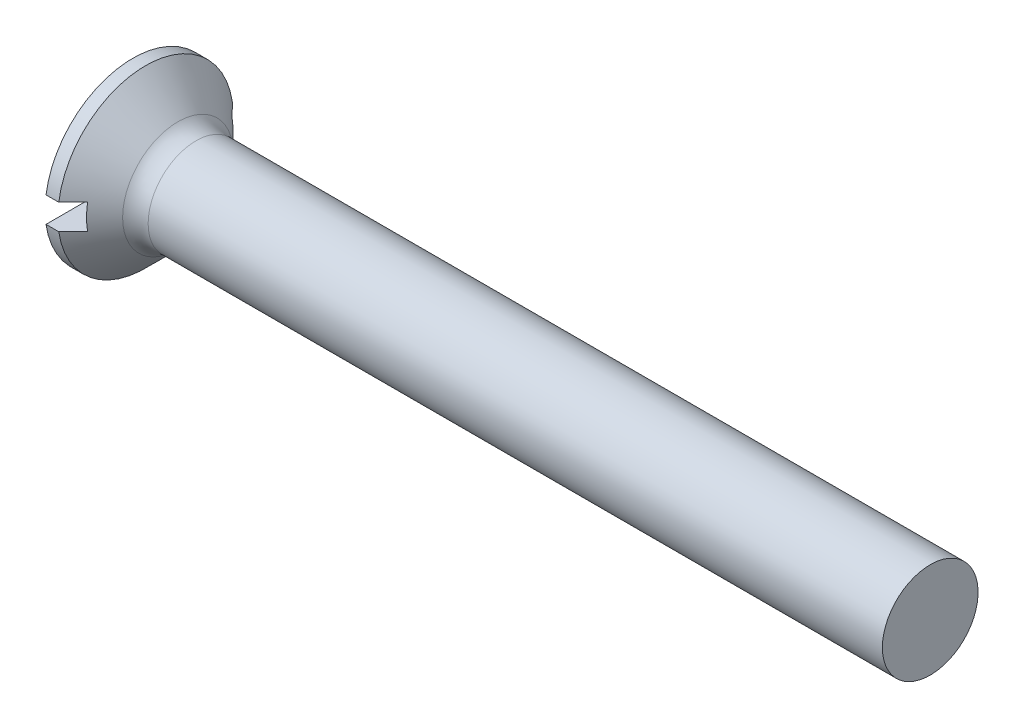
ISO-10303-21;
HEADER;
FILE_DESCRIPTION(('STEP AP214'),'2;1');
FILE_NAME('part.step','',(''),(''),'','','');
FILE_SCHEMA(('AUTOMOTIVE_DESIGN { 1 0 10303 214 1 1 1 1 }'));
ENDSEC;
DATA;
#1=APPLICATION_CONTEXT('core data for automotive mechanical design processes');
#2=APPLICATION_PROTOCOL_DEFINITION('international standard','automotive_design',2000,#1);
#3=PRODUCT_CONTEXT('',#1,'mechanical');
#4=PRODUCT('Part','Part','',(#3));
#5=PRODUCT_RELATED_PRODUCT_CATEGORY('part','',(#4));
#6=PRODUCT_DEFINITION_FORMATION('','',#4);
#7=PRODUCT_DEFINITION_CONTEXT('part definition',#1,'design');
#8=PRODUCT_DEFINITION('design','',#6,#7);
#9=PRODUCT_DEFINITION_SHAPE('','',#8);
#10=(LENGTH_UNIT() NAMED_UNIT(*) SI_UNIT(.MILLI.,.METRE.));
#11=(NAMED_UNIT(*) PLANE_ANGLE_UNIT() SI_UNIT($,.RADIAN.));
#12=(NAMED_UNIT(*) SI_UNIT($,.STERADIAN.) SOLID_ANGLE_UNIT());
#13=UNCERTAINTY_MEASURE_WITH_UNIT(LENGTH_MEASURE(1.E-05),#10,'distance_accuracy_value','');
#14=(GEOMETRIC_REPRESENTATION_CONTEXT(3) GLOBAL_UNCERTAINTY_ASSIGNED_CONTEXT((#13)) GLOBAL_UNIT_ASSIGNED_CONTEXT((#10,
#11,#12)) REPRESENTATION_CONTEXT('',''));
#15=CARTESIAN_POINT('',(0.,0.,0.));
#16=DIRECTION('',(0.,0.,1.));
#17=DIRECTION('',(1.,0.,0.));
#18=AXIS2_PLACEMENT_3D('',#15,#16,#17);
#19=CARTESIAN_POINT('',(0.,0.,0.));
#20=DIRECTION('',(-1.,0.,0.));
#21=DIRECTION('',(0.,0.,1.));
#22=AXIS2_PLACEMENT_3D('',#19,#20,#21);
#23=PLANE('',#22);
#24=DIRECTION('',(0.,0.,-1.));
#25=VECTOR('',#24,1.);
#26=CARTESIAN_POINT('',(0.,0.4,2.75));
#27=LINE('',#26,#25);
#28=CARTESIAN_POINT('',(0.,0.4,2.72075357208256));
#29=VERTEX_POINT('',#28);
#30=CARTESIAN_POINT('',(0.,0.4,-2.72075357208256));
#31=VERTEX_POINT('',#30);
#32=EDGE_CURVE('E177',#29,#31,#27,.T.);
#33=ORIENTED_EDGE('',*,*,#32,.F.);
#34=CARTESIAN_POINT('',(0.,0.,0.));
#35=DIRECTION('',(-1.,0.,0.));
#36=DIRECTION('',(0.,0.,1.));
#37=AXIS2_PLACEMENT_3D('',#34,#35,#36);
#38=CIRCLE('',#37,2.75);
#39=EDGE_CURVE('E142',#29,#31,#38,.T.);
#40=ORIENTED_EDGE('',*,*,#39,.T.);
#41=EDGE_LOOP('',(#33,#40));
#42=FACE_BOUND('',#41,.T.);
#43=ADVANCED_FACE('F36',(#42),#23,.T.);
#44=CARTESIAN_POINT('',(-6.34999999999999,0.,0.));
#45=DIRECTION('',(-1.,0.,0.));
#46=DIRECTION('',(0.,0.,1.));
#47=AXIS2_PLACEMENT_3D('',#44,#45,#46);
#48=CYLINDRICAL_SURFACE('',#47,2.75);
#49=DIRECTION('',(-1.,0.,0.));
#50=VECTOR('',#49,1.);
#51=CARTESIAN_POINT('',(-6.34999999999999,0.4,-2.72075357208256));
#52=LINE('',#51,#50);
#53=CARTESIAN_POINT('',(0.400000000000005,0.4,-2.72075357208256));
#54=VERTEX_POINT('',#53);
#55=EDGE_CURVE('E64',#31,#54,#52,.F.);
#56=ORIENTED_EDGE('',*,*,#55,.F.);
#57=ORIENTED_EDGE('',*,*,#39,.F.);
#58=DIRECTION('',(-1.,0.,0.));
#59=VECTOR('',#58,1.);
#60=CARTESIAN_POINT('',(-6.34999999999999,0.4,2.72075357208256));
#61=LINE('',#60,#59);
#62=CARTESIAN_POINT('',(0.400000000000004,0.4,2.72075357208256));
#63=VERTEX_POINT('',#62);
#64=EDGE_CURVE('E183',#63,#29,#61,.T.);
#65=ORIENTED_EDGE('',*,*,#64,.F.);
#66=CARTESIAN_POINT('',(0.400000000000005,0.,0.));
#67=DIRECTION('',(-1.,0.,0.));
#68=DIRECTION('',(0.,0.,1.));
#69=AXIS2_PLACEMENT_3D('',#66,#67,#68);
#70=CIRCLE('',#69,2.75);
#71=EDGE_CURVE('E113',#63,#54,#70,.T.);
#72=ORIENTED_EDGE('',*,*,#71,.T.);
#73=EDGE_LOOP('',(#56,#57,#65,#72));
#74=FACE_BOUND('',#73,.T.);
#75=ADVANCED_FACE('F164',(#74),#48,.T.);
#76=DIRECTION('',(0.,0.,1.));
#77=VECTOR('',#76,1.);
#78=CARTESIAN_POINT('',(0.,-0.400000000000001,-2.75));
#79=LINE('',#78,#77);
#80=CARTESIAN_POINT('',(0.,-0.400000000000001,-2.72075357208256));
#81=VERTEX_POINT('',#80);
#82=CARTESIAN_POINT('',(0.,-0.400000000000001,2.72075357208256));
#83=VERTEX_POINT('',#82);
#84=EDGE_CURVE('E107',#81,#83,#79,.T.);
#85=ORIENTED_EDGE('',*,*,#84,.F.);
#86=EDGE_CURVE('E132',#81,#83,#38,.T.);
#87=ORIENTED_EDGE('',*,*,#86,.T.);
#88=EDGE_LOOP('',(#85,#87));
#89=FACE_BOUND('',#88,.T.);
#90=ADVANCED_FACE('F162',(#89),#23,.T.);
#91=DIRECTION('',(-1.,0.,0.));
#92=VECTOR('',#91,1.);
#93=CARTESIAN_POINT('',(-6.34999999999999,-0.400000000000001,2.72075357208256));
#94=LINE('',#93,#92);
#95=CARTESIAN_POINT('',(0.400000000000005,-0.400000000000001,2.72075357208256));
#96=VERTEX_POINT('',#95);
#97=EDGE_CURVE('E133',#83,#96,#94,.F.);
#98=ORIENTED_EDGE('',*,*,#97,.F.);
#99=ORIENTED_EDGE('',*,*,#86,.F.);
#100=DIRECTION('',(-1.,0.,0.));
#101=VECTOR('',#100,1.);
#102=CARTESIAN_POINT('',(-6.34999999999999,-0.400000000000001,-2.72075357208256));
#103=LINE('',#102,#101);
#104=CARTESIAN_POINT('',(0.400000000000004,-0.400000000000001,-2.72075357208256));
#105=VERTEX_POINT('',#104);
#106=EDGE_CURVE('E122',#105,#81,#103,.T.);
#107=ORIENTED_EDGE('',*,*,#106,.F.);
#108=EDGE_CURVE('E130',#105,#96,#70,.T.);
#109=ORIENTED_EDGE('',*,*,#108,.T.);
#110=EDGE_LOOP('',(#98,#99,#107,#109));
#111=FACE_BOUND('',#110,.T.);
#112=ADVANCED_FACE('F129',(#111),#48,.T.);
#113=CARTESIAN_POINT('',(0.400000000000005,0.,0.));
#114=DIRECTION('',(-1.,0.,0.));
#115=DIRECTION('',(0.,0.,1.));
#116=AXIS2_PLACEMENT_3D('',#113,#114,#115);
#117=CONICAL_SURFACE('',#116,2.75,0.78539816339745);
#118=CARTESIAN_POINT('',(-2.91122703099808,0.399999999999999,-6.04801398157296));
#119=CARTESIAN_POINT('',(-2.70333669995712,0.399999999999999,-5.83966573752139));
#120=CARTESIAN_POINT('',(-2.49546630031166,0.399999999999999,-5.63129758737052));
#121=CARTESIAN_POINT('',(-2.07978706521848,0.399999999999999,-5.2144912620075));
#122=CARTESIAN_POINT('',(-1.87197823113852,0.399999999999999,-5.00605308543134));
#123=CARTESIAN_POINT('',(-1.45635477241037,0.399999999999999,-4.58898711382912));
#124=CARTESIAN_POINT('',(-1.2485401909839,0.399999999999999,-4.38035927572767));
#125=CARTESIAN_POINT('',(-0.833054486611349,0.399999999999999,-3.96296915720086));
#126=CARTESIAN_POINT('',(-0.625383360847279,0.399999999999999,-3.75420687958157));
#127=CARTESIAN_POINT('',(-0.208177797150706,0.399999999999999,-3.33435396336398));
#128=CARTESIAN_POINT('',(0.00135434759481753,0.4,-3.12326104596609));
#129=CARTESIAN_POINT('',(0.420030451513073,0.4,-2.70066518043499));
#130=CARTESIAN_POINT('',(0.629174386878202,0.4,-2.48916220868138));
#131=CARTESIAN_POINT('',(0.942224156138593,0.4,-2.1713129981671));
#132=CARTESIAN_POINT('',(1.04644766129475,0.4,-2.06527989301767));
#133=CARTESIAN_POINT('',(1.25455725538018,0.4,-1.85287805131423));
#134=CARTESIAN_POINT('',(1.35844333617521,0.4,-1.7465093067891));
#135=CARTESIAN_POINT('',(1.56564763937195,0.4,-1.53324094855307));
#136=CARTESIAN_POINT('',(1.66896592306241,0.4,-1.42634139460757));
#137=CARTESIAN_POINT('',(1.82313895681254,0.4,-1.26522565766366));
#138=CARTESIAN_POINT('',(1.87439491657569,0.4,-1.21139372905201));
#139=CARTESIAN_POINT('',(1.9765104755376,0.4,-1.10335558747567));
#140=CARTESIAN_POINT('',(2.02737008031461,0.4,-1.04914937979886));
#141=CARTESIAN_POINT('',(2.10536761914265,0.4,-0.965078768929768));
#142=CARTESIAN_POINT('',(2.13272119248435,0.4,-0.935414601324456));
#143=CARTESIAN_POINT('',(2.18719151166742,0.4,-0.875868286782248));
#144=CARTESIAN_POINT('',(2.21430825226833,0.4,-0.845986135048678));
#145=CARTESIAN_POINT('',(2.26822565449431,0.4,-0.785940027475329));
#146=CARTESIAN_POINT('',(2.29502633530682,0.4,-0.755776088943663));
#147=CARTESIAN_POINT('',(2.34818681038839,0.4,-0.695065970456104));
#148=CARTESIAN_POINT('',(2.37454662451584,0.4,-0.664519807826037));
#149=CARTESIAN_POINT('',(2.43976155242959,0.4,-0.587422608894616));
#150=CARTESIAN_POINT('',(2.4782379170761,0.4,-0.540543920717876));
#151=CARTESIAN_POINT('',(2.53401321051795,0.4,-0.468681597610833));
#152=CARTESIAN_POINT('',(2.55228877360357,0.4,-0.444459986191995));
#153=CARTESIAN_POINT('',(2.5878711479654,0.4,-0.39531915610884));
#154=CARTESIAN_POINT('',(2.60517823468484,0.4,-0.370400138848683));
#155=CARTESIAN_POINT('',(2.64157672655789,0.4,-0.314684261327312));
#156=CARTESIAN_POINT('',(2.66036306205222,0.4,-0.28368484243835));
#157=CARTESIAN_POINT('',(2.69440764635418,0.4,-0.219761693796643));
#158=CARTESIAN_POINT('',(2.70967206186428,0.4,-0.186841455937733));
#159=CARTESIAN_POINT('',(2.73016014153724,0.4,-0.129375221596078));
#160=CARTESIAN_POINT('',(2.73703138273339,0.4,-0.105439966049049));
#161=CARTESIAN_POINT('',(2.74668434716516,0.4,-0.0567945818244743));
#162=CARTESIAN_POINT('',(2.74948035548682,0.4,-0.0320874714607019));
#163=CARTESIAN_POINT('',(2.75038742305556,0.4,0.0175418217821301));
#164=CARTESIAN_POINT('',(2.74847509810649,0.4,0.0424644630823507));
#165=CARTESIAN_POINT('',(2.7403655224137,0.4,0.0916234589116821));
#166=CARTESIAN_POINT('',(2.73415677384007,0.4,0.115857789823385));
#167=CARTESIAN_POINT('',(2.71827371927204,0.4,0.164097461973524));
#168=CARTESIAN_POINT('',(2.70848082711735,0.4,0.188061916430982));
#169=CARTESIAN_POINT('',(2.68657810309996,0.4,0.234925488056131));
#170=CARTESIAN_POINT('',(2.67446406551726,0.4,0.257822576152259));
#171=CARTESIAN_POINT('',(2.64859519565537,0.4,0.302903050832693));
#172=CARTESIAN_POINT('',(2.63482775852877,0.4,0.325079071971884));
#173=CARTESIAN_POINT('',(2.60624001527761,0.4,0.368705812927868));
#174=CARTESIAN_POINT('',(2.59142061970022,0.4,0.390157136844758));
#175=CARTESIAN_POINT('',(2.54324495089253,0.4,0.457380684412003));
#176=CARTESIAN_POINT('',(2.5085311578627,0.4,0.502172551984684));
#177=CARTESIAN_POINT('',(2.4373574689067,0.4,0.590355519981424));
#178=CARTESIAN_POINT('',(2.40089644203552,0.4,0.633745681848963));
#179=CARTESIAN_POINT('',(2.32688330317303,0.4,0.719722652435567));
#180=CARTESIAN_POINT('',(2.28932931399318,0.4,0.762307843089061));
#181=CARTESIAN_POINT('',(2.21358878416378,0.4,0.846885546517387));
#182=CARTESIAN_POINT('',(2.17540243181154,0.4,0.888878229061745));
#183=CARTESIAN_POINT('',(2.06044068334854,0.4,1.01402227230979));
#184=CARTESIAN_POINT('',(1.98303698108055,0.4,1.09659540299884));
#185=CARTESIAN_POINT('',(1.82747335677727,0.4,1.26085212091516));
#186=CARTESIAN_POINT('',(1.74931433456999,0.4,1.34253656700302));
#187=CARTESIAN_POINT('',(1.59286602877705,0.4,1.50504082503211));
#188=CARTESIAN_POINT('',(1.51457909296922,0.4,1.58586289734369));
#189=CARTESIAN_POINT('',(1.35769196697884,0.4,1.74720261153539));
#190=CARTESIAN_POINT('',(1.27909177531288,0.4,1.82772025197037));
#191=CARTESIAN_POINT('',(1.04297819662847,0.4,2.06897290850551));
#192=CARTESIAN_POINT('',(0.885154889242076,0.4,2.22940447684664));
#193=CARTESIAN_POINT('',(0.569022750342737,0.4,2.54992542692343));
#194=CARTESIAN_POINT('',(0.410713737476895,0.4,2.71001462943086));
#195=CARTESIAN_POINT('',(0.093846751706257,0.4,3.02994348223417));
#196=CARTESIAN_POINT('',(-0.0647112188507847,0.4,3.18978313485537));
#197=CARTESIAN_POINT('',(-0.540591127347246,0.4,3.66904928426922));
#198=CARTESIAN_POINT('',(-0.858143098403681,0.400000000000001,3.98824727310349));
#199=CARTESIAN_POINT('',(-1.49349686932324,0.400000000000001,4.62632608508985));
#200=CARTESIAN_POINT('',(-1.81129863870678,0.400000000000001,4.94520693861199));
#201=CARTESIAN_POINT('',(-2.25950055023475,0.400000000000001,5.39470040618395));
#202=CARTESIAN_POINT('',(-2.38983276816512,0.400000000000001,5.5253807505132));
#203=CARTESIAN_POINT('',(-2.65051602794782,0.400000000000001,5.78671502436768));
#204=CARTESIAN_POINT('',(-2.78086706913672,0.400000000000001,5.91736895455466));
#205=CARTESIAN_POINT('',(-2.91122703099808,0.400000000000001,6.04801398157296));
#206=B_SPLINE_CURVE_WITH_KNOTS('',3,(#118,#119,#120,#121,#122,#123,#124,#125,#126,#127,#128,
#129,#130,#131,#132,#133,#134,#135,#136,#137,#138,#139,#140,#141,#142,#143,#144,#145,#146,#147,
#148,#149,#150,#151,#152,#153,#154,#155,#156,#157,#158,#159,#160,#161,#162,#163,#164,#165,#166,
#167,#168,#169,#170,#171,#172,#173,#174,#175,#176,#177,#178,#179,#180,#181,#182,#183,#184,#185,
#186,#187,#188,#189,#190,#191,#192,#193,#194,#195,#196,#197,#198,#199,#200,#201,#202,#203,#204,
#205),.UNSPECIFIED.,.F.,.F.,(4,2,2,2,2,2,2,2,2,2,2,2,2,2,2,2,2,2,2,2,2,2,2,2,2,2,2,2,2,2,2,2,2,
2,2,2,2,2,2,2,2,2,2,4),(0.,0.882975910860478,1.76597015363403,2.64937958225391,3.53277113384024,
4.42505762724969,5.31739714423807,5.76343472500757,6.20948297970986,6.65548210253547,
6.87847301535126,7.10146078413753,7.22251193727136,7.34356576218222,7.46461219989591,
7.58565317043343,7.7675312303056,7.85854400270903,7.94953075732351,8.05816632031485,
8.16661019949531,8.24105170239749,8.31523162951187,8.38978071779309,8.46453008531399,
8.54201686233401,8.61964538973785,8.69790858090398,8.77610483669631,8.94600506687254,
9.11601679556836,9.28634010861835,9.45661358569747,9.79613758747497,10.1352975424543,
10.4728599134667,10.8104238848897,11.4855651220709,12.1610000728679,12.8364286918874,
14.1871833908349,15.5377930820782,16.0914848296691,16.6451603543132),.UNSPECIFIED.);
#207=CARTESIAN_POINT('',(0.85,0.4,-2.26495033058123));
#208=VERTEX_POINT('',#207);
#209=EDGE_CURVE('E11',#54,#208,#206,.T.);
#210=ORIENTED_EDGE('',*,*,#209,.F.);
#211=ORIENTED_EDGE('',*,*,#71,.F.);
#212=CARTESIAN_POINT('',(0.85,0.4,2.26495033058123));
#213=VERTEX_POINT('',#212);
#214=EDGE_CURVE('E40',#213,#63,#206,.T.);
#215=ORIENTED_EDGE('',*,*,#214,.F.);
#216=CARTESIAN_POINT('',(0.85,0.,0.));
#217=DIRECTION('',(-1.,0.,0.));
#218=DIRECTION('',(0.,0.,1.));
#219=AXIS2_PLACEMENT_3D('',#216,#217,#218);
#220=CIRCLE('',#219,2.3);
#221=CARTESIAN_POINT('',(0.85,-0.400000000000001,2.26495033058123));
#222=VERTEX_POINT('',#221);
#223=EDGE_CURVE('E93',#213,#222,#220,.F.);
#224=ORIENTED_EDGE('',*,*,#223,.T.);
#225=CARTESIAN_POINT('',(-2.91122703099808,-0.400000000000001,6.04801398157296));
#226=CARTESIAN_POINT('',(-2.70333669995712,-0.400000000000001,5.83966573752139));
#227=CARTESIAN_POINT('',(-2.49546630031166,-0.400000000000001,5.63129758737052));
#228=CARTESIAN_POINT('',(-2.07978706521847,-0.400000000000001,5.2144912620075));
#229=CARTESIAN_POINT('',(-1.87197823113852,-0.400000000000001,5.00605308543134));
#230=CARTESIAN_POINT('',(-1.45635477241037,-0.400000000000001,4.58898711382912));
#231=CARTESIAN_POINT('',(-1.2485401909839,-0.400000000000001,4.38035927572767));
#232=CARTESIAN_POINT('',(-0.833054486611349,-0.400000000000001,3.96296915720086));
#233=CARTESIAN_POINT('',(-0.625383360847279,-0.400000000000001,3.75420687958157));
#234=CARTESIAN_POINT('',(-0.208177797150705,-0.400000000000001,3.33435396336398));
#235=CARTESIAN_POINT('',(0.00135434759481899,-0.400000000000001,3.12326104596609));
#236=CARTESIAN_POINT('',(0.420030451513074,-0.400000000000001,2.70066518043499));
#237=CARTESIAN_POINT('',(0.629174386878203,-0.400000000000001,2.48916220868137));
#238=CARTESIAN_POINT('',(0.942224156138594,-0.400000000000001,2.1713129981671));
#239=CARTESIAN_POINT('',(1.04644766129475,-0.400000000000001,2.06527989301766));
#240=CARTESIAN_POINT('',(1.25455725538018,-0.400000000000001,1.85287805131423));
#241=CARTESIAN_POINT('',(1.35844333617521,-0.400000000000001,1.7465093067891));
#242=CARTESIAN_POINT('',(1.56564763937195,-0.400000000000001,1.53324094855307));
#243=CARTESIAN_POINT('',(1.66896592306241,-0.400000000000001,1.42634139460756));
#244=CARTESIAN_POINT('',(1.82313895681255,-0.400000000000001,1.26522565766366));
#245=CARTESIAN_POINT('',(1.87439491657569,-0.400000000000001,1.211393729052));
#246=CARTESIAN_POINT('',(1.97651047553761,-0.400000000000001,1.10335558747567));
#247=CARTESIAN_POINT('',(2.02737008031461,-0.400000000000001,1.04914937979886));
#248=CARTESIAN_POINT('',(2.10536761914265,-0.400000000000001,0.965078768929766));
#249=CARTESIAN_POINT('',(2.13272119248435,-0.400000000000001,0.935414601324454));
#250=CARTESIAN_POINT('',(2.18719151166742,-0.400000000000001,0.875868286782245));
#251=CARTESIAN_POINT('',(2.21430825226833,-0.400000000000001,0.845986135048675));
#252=CARTESIAN_POINT('',(2.26822565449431,-0.400000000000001,0.785940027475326));
#253=CARTESIAN_POINT('',(2.29502633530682,-0.400000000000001,0.755776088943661));
#254=CARTESIAN_POINT('',(2.3481868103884,-0.400000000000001,0.695065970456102));
#255=CARTESIAN_POINT('',(2.37454662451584,-0.400000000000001,0.664519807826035));
#256=CARTESIAN_POINT('',(2.43976155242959,-0.400000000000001,0.587422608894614));
#257=CARTESIAN_POINT('',(2.4782379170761,-0.400000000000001,0.540543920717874));
#258=CARTESIAN_POINT('',(2.53401321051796,-0.400000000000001,0.468681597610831));
#259=CARTESIAN_POINT('',(2.55228877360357,-0.400000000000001,0.444459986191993));
#260=CARTESIAN_POINT('',(2.5878711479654,-0.400000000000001,0.395319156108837));
#261=CARTESIAN_POINT('',(2.60517823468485,-0.400000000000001,0.37040013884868));
#262=CARTESIAN_POINT('',(2.64157672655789,-0.400000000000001,0.314684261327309));
#263=CARTESIAN_POINT('',(2.66036306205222,-0.400000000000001,0.283684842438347));
#264=CARTESIAN_POINT('',(2.69440764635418,-0.400000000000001,0.219761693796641));
#265=CARTESIAN_POINT('',(2.70967206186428,-0.400000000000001,0.186841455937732));
#266=CARTESIAN_POINT('',(2.73016014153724,-0.400000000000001,0.129375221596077));
#267=CARTESIAN_POINT('',(2.73703138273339,-0.400000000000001,0.105439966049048));
#268=CARTESIAN_POINT('',(2.74668434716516,-0.400000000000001,0.056794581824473));
#269=CARTESIAN_POINT('',(2.74948035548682,-0.400000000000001,0.0320874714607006));
#270=CARTESIAN_POINT('',(2.75038742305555,-0.400000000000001,-0.0175418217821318));
#271=CARTESIAN_POINT('',(2.74847509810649,-0.400000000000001,-0.0424644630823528));
#272=CARTESIAN_POINT('',(2.7403655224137,-0.400000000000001,-0.0916234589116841));
#273=CARTESIAN_POINT('',(2.73415677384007,-0.400000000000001,-0.115857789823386));
#274=CARTESIAN_POINT('',(2.71827371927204,-0.400000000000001,-0.164097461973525));
#275=CARTESIAN_POINT('',(2.70848082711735,-0.400000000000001,-0.188061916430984));
#276=CARTESIAN_POINT('',(2.68657810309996,-0.400000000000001,-0.234925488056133));
#277=CARTESIAN_POINT('',(2.67446406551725,-0.400000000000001,-0.257822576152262));
#278=CARTESIAN_POINT('',(2.64859519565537,-0.400000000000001,-0.302903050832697));
#279=CARTESIAN_POINT('',(2.63482775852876,-0.400000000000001,-0.325079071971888));
#280=CARTESIAN_POINT('',(2.60624001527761,-0.400000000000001,-0.368705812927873));
#281=CARTESIAN_POINT('',(2.59142061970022,-0.400000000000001,-0.390157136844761));
#282=CARTESIAN_POINT('',(2.54324495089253,-0.400000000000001,-0.457380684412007));
#283=CARTESIAN_POINT('',(2.5085311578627,-0.400000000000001,-0.502172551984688));
#284=CARTESIAN_POINT('',(2.43735746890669,-0.400000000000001,-0.590355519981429));
#285=CARTESIAN_POINT('',(2.40089644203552,-0.400000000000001,-0.633745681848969));
#286=CARTESIAN_POINT('',(2.32688330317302,-0.400000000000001,-0.719722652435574));
#287=CARTESIAN_POINT('',(2.28932931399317,-0.400000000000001,-0.762307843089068));
#288=CARTESIAN_POINT('',(2.21358878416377,-0.400000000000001,-0.846885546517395));
#289=CARTESIAN_POINT('',(2.17540243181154,-0.400000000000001,-0.888878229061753));
#290=CARTESIAN_POINT('',(2.06044068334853,-0.400000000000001,-1.01402227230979));
#291=CARTESIAN_POINT('',(1.98303698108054,-0.400000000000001,-1.09659540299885));
#292=CARTESIAN_POINT('',(1.82747335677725,-0.400000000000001,-1.26085212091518));
#293=CARTESIAN_POINT('',(1.74931433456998,-0.400000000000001,-1.34253656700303));
#294=CARTESIAN_POINT('',(1.59286602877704,-0.400000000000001,-1.50504082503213));
#295=CARTESIAN_POINT('',(1.51457909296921,-0.400000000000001,-1.5858628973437));
#296=CARTESIAN_POINT('',(1.35769196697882,-0.400000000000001,-1.74720261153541));
#297=CARTESIAN_POINT('',(1.27909177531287,-0.400000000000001,-1.82772025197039));
#298=CARTESIAN_POINT('',(1.04297819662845,-0.400000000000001,-2.06897290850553));
#299=CARTESIAN_POINT('',(0.885154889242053,-0.400000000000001,-2.22940447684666));
#300=CARTESIAN_POINT('',(0.56902275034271,-0.400000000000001,-2.54992542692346));
#301=CARTESIAN_POINT('',(0.410713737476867,-0.400000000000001,-2.71001462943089));
#302=CARTESIAN_POINT('',(0.0938467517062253,-0.400000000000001,-3.0299434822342));
#303=CARTESIAN_POINT('',(-0.0647112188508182,-0.400000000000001,-3.1897831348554));
#304=CARTESIAN_POINT('',(-0.540591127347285,-0.400000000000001,-3.66904928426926));
#305=CARTESIAN_POINT('',(-0.858143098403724,-0.400000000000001,-3.98824727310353));
#306=CARTESIAN_POINT('',(-1.49349686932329,-0.400000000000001,-4.62632608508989));
#307=CARTESIAN_POINT('',(-1.81129863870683,-0.400000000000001,-4.94520693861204));
#308=CARTESIAN_POINT('',(-2.25950055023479,-0.400000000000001,-5.394700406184));
#309=CARTESIAN_POINT('',(-2.38983276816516,-0.400000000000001,-5.52538075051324));
#310=CARTESIAN_POINT('',(-2.65051602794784,-0.400000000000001,-5.7867150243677));
#311=CARTESIAN_POINT('',(-2.78086706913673,-0.400000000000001,-5.91736895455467));
#312=CARTESIAN_POINT('',(-2.91122703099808,-0.400000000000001,-6.04801398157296));
#313=B_SPLINE_CURVE_WITH_KNOTS('',3,(#225,#226,#227,#228,#229,#230,#231,#232,#233,#234,#235,
#236,#237,#238,#239,#240,#241,#242,#243,#244,#245,#246,#247,#248,#249,#250,#251,#252,#253,#254,
#255,#256,#257,#258,#259,#260,#261,#262,#263,#264,#265,#266,#267,#268,#269,#270,#271,#272,#273,
#274,#275,#276,#277,#278,#279,#280,#281,#282,#283,#284,#285,#286,#287,#288,#289,#290,#291,#292,
#293,#294,#295,#296,#297,#298,#299,#300,#301,#302,#303,#304,#305,#306,#307,#308,#309,#310,#311,
#312),.UNSPECIFIED.,.F.,.F.,(4,2,2,2,2,2,2,2,2,2,2,2,2,2,2,2,2,2,2,2,2,2,2,2,2,2,2,2,2,2,2,2,2,
2,2,2,2,2,2,2,2,2,2,4),(0.,0.882975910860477,1.76597015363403,2.6493795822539,3.53277113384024,
4.42505762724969,5.31739714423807,5.76343472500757,6.20948297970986,6.65548210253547,
6.87847301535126,7.10146078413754,7.22251193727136,7.34356576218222,7.46461219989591,
7.58565317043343,7.7675312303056,7.85854400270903,7.94953075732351,8.05816632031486,
8.16661019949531,8.24105170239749,8.31523162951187,8.38978071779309,8.46453008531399,
8.542016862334,8.61964538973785,8.69790858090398,8.77610483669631,8.94600506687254,
9.11601679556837,9.28634010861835,9.45661358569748,9.79613758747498,10.1352975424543,
10.4728599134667,10.8104238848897,11.4855651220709,12.1610000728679,12.8364286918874,
14.1871833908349,15.5377930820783,16.0914848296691,16.6451603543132),.UNSPECIFIED.);
#314=EDGE_CURVE('E101',#96,#222,#313,.T.);
#315=ORIENTED_EDGE('',*,*,#314,.F.);
#316=ORIENTED_EDGE('',*,*,#108,.F.);
#317=CARTESIAN_POINT('',(0.85,-0.400000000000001,-2.26495033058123));
#318=VERTEX_POINT('',#317);
#319=EDGE_CURVE('E50',#318,#105,#313,.T.);
#320=ORIENTED_EDGE('',*,*,#319,.F.);
#321=EDGE_CURVE('E104',#318,#208,#220,.F.);
#322=ORIENTED_EDGE('',*,*,#321,.T.);
#323=EDGE_LOOP('',(#210,#211,#215,#224,#315,#316,#320,#322));
#324=FACE_BOUND('',#323,.T.);
#325=CARTESIAN_POINT('',(1.41568542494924,0.,0.));
#326=DIRECTION('',(-1.,0.,0.));
#327=DIRECTION('',(0.,0.,1.));
#328=AXIS2_PLACEMENT_3D('',#325,#326,#327);
#329=CIRCLE('',#328,1.73431457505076);
#330=CARTESIAN_POINT('',(1.41568542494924,0.,1.73431457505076));
#331=VERTEX_POINT('',#330);
#332=EDGE_CURVE('E143',#331,#331,#329,.T.);
#333=ORIENTED_EDGE('',*,*,#332,.T.);
#334=EDGE_LOOP('',(#333));
#335=FACE_BOUND('',#334,.T.);
#336=ADVANCED_FACE('F110',(#324,#335),#117,.T.);
#337=CARTESIAN_POINT('',(-6.34999999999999,0.,0.));
#338=DIRECTION('',(-1.,0.,0.));
#339=DIRECTION('',(0.,0.,1.));
#340=AXIS2_PLACEMENT_3D('',#337,#338,#339);
#341=CYLINDRICAL_SURFACE('',#340,1.5);
#342=CARTESIAN_POINT('',(1.98137084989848,0.,0.));
#343=DIRECTION('',(-1.,0.,0.));
#344=DIRECTION('',(0.,0.,1.));
#345=AXIS2_PLACEMENT_3D('',#342,#343,#344);
#346=CIRCLE('',#345,1.5);
#347=CARTESIAN_POINT('',(1.98137084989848,0.,1.5));
#348=VERTEX_POINT('',#347);
#349=EDGE_CURVE('E102',#348,#348,#346,.F.);
#350=ORIENTED_EDGE('',*,*,#349,.T.);
#351=EDGE_LOOP('',(#350));
#352=FACE_BOUND('',#351,.T.);
#353=CARTESIAN_POINT('',(25.,0.,0.));
#354=DIRECTION('',(-1.,0.,0.));
#355=DIRECTION('',(0.,0.,1.));
#356=AXIS2_PLACEMENT_3D('',#353,#354,#355);
#357=CIRCLE('',#356,1.5);
#358=CARTESIAN_POINT('',(25.,0.,1.5));
#359=VERTEX_POINT('',#358);
#360=EDGE_CURVE('E135',#359,#359,#357,.T.);
#361=ORIENTED_EDGE('',*,*,#360,.T.);
#362=EDGE_LOOP('',(#361));
#363=FACE_BOUND('',#362,.T.);
#364=ADVANCED_FACE('F149',(#352,#363),#341,.T.);
#365=CARTESIAN_POINT('',(25.,1.5,0.));
#366=DIRECTION('',(1.,0.,0.));
#367=DIRECTION('',(0.,0.,-1.));
#368=AXIS2_PLACEMENT_3D('',#365,#366,#367);
#369=PLANE('',#368);
#370=ORIENTED_EDGE('',*,*,#360,.F.);
#371=EDGE_LOOP('',(#370));
#372=FACE_BOUND('',#371,.T.);
#373=ADVANCED_FACE('F154',(#372),#369,.T.);
#374=CARTESIAN_POINT('',(1.98137084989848,0.,0.));
#375=DIRECTION('',(-1.,0.,0.));
#376=DIRECTION('',(0.,0.,1.));
#377=AXIS2_PLACEMENT_3D('',#374,#375,#376);
#378=TOROIDAL_SURFACE('',#377,2.3,0.8);
#379=ORIENTED_EDGE('',*,*,#349,.F.);
#380=EDGE_LOOP('',(#379));
#381=FACE_BOUND('',#380,.T.);
#382=ORIENTED_EDGE('',*,*,#332,.F.);
#383=EDGE_LOOP('',(#382));
#384=FACE_BOUND('',#383,.T.);
#385=ADVANCED_FACE('F38',(#381,#384),#378,.F.);
#386=CARTESIAN_POINT('',(0.85,0.4,2.75));
#387=DIRECTION('',(0.,1.,0.));
#388=DIRECTION('',(0.,0.,1.));
#389=AXIS2_PLACEMENT_3D('',#386,#387,#388);
#390=PLANE('',#389);
#391=ORIENTED_EDGE('',*,*,#55,.T.);
#392=ORIENTED_EDGE('',*,*,#209,.T.);
#393=DIRECTION('',(0.,0.,-1.));
#394=VECTOR('',#393,1.);
#395=CARTESIAN_POINT('',(0.85,0.4,2.75));
#396=LINE('',#395,#394);
#397=EDGE_CURVE('E96',#213,#208,#396,.T.);
#398=ORIENTED_EDGE('',*,*,#397,.F.);
#399=ORIENTED_EDGE('',*,*,#214,.T.);
#400=ORIENTED_EDGE('',*,*,#64,.T.);
#401=ORIENTED_EDGE('',*,*,#32,.T.);
#402=EDGE_LOOP('',(#391,#392,#398,#399,#400,#401));
#403=FACE_BOUND('',#402,.T.);
#404=ADVANCED_FACE('F105',(#403),#390,.F.);
#405=CARTESIAN_POINT('',(0.85,-0.400000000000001,-2.75));
#406=DIRECTION('',(0.,-1.,0.));
#407=DIRECTION('',(0.,0.,-1.));
#408=AXIS2_PLACEMENT_3D('',#405,#406,#407);
#409=PLANE('',#408);
#410=ORIENTED_EDGE('',*,*,#97,.T.);
#411=ORIENTED_EDGE('',*,*,#314,.T.);
#412=DIRECTION('',(0.,0.,1.));
#413=VECTOR('',#412,1.);
#414=CARTESIAN_POINT('',(0.85,-0.400000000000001,-2.75));
#415=LINE('',#414,#413);
#416=EDGE_CURVE('E57',#318,#222,#415,.T.);
#417=ORIENTED_EDGE('',*,*,#416,.F.);
#418=ORIENTED_EDGE('',*,*,#319,.T.);
#419=ORIENTED_EDGE('',*,*,#106,.T.);
#420=ORIENTED_EDGE('',*,*,#84,.T.);
#421=EDGE_LOOP('',(#410,#411,#417,#418,#419,#420));
#422=FACE_BOUND('',#421,.T.);
#423=ADVANCED_FACE('F121',(#422),#409,.F.);
#424=CARTESIAN_POINT('',(0.85,0.4,-2.75));
#425=DIRECTION('',(-1.,0.,0.));
#426=DIRECTION('',(0.,0.,1.));
#427=AXIS2_PLACEMENT_3D('',#424,#425,#426);
#428=PLANE('',#427);
#429=ORIENTED_EDGE('',*,*,#416,.T.);
#430=ORIENTED_EDGE('',*,*,#223,.F.);
#431=ORIENTED_EDGE('',*,*,#397,.T.);
#432=ORIENTED_EDGE('',*,*,#321,.F.);
#433=EDGE_LOOP('',(#429,#430,#431,#432));
#434=FACE_BOUND('',#433,.T.);
#435=ADVANCED_FACE('F95',(#434),#428,.T.);
#436=CLOSED_SHELL('',(#43,#75,#90,#112,#336,#364,#373,#385,#404,#423,#435));
#437=MANIFOLD_SOLID_BREP('B2',#436);
#438=ADVANCED_BREP_SHAPE_REPRESENTATION('',(#18,#437),#14);
#439=SHAPE_DEFINITION_REPRESENTATION(#9,#438);
ENDSEC;
END-ISO-10303-21;
